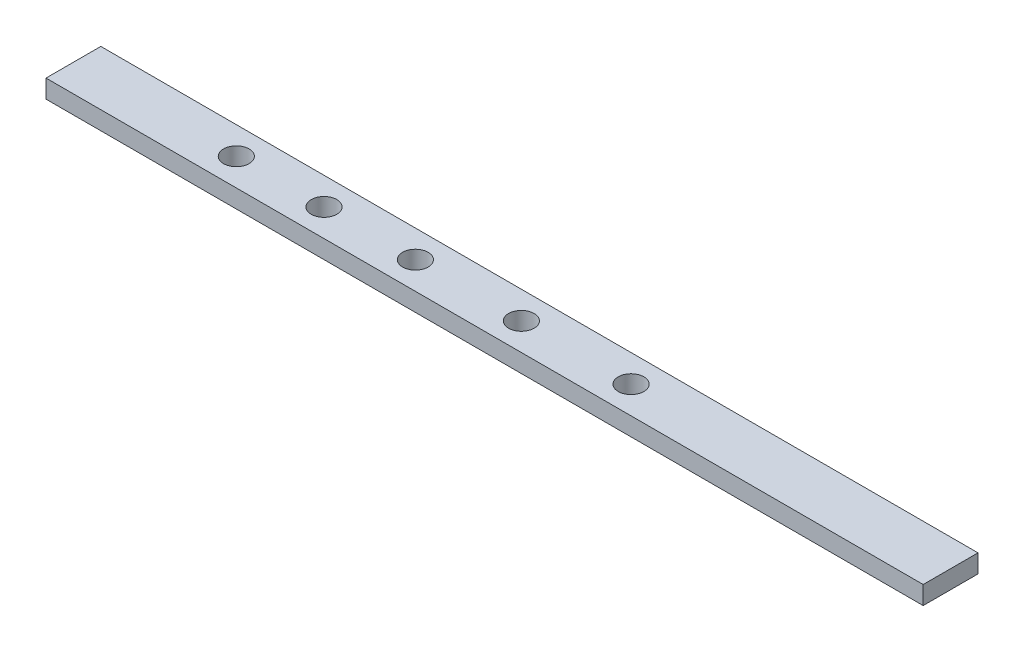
ISO-10303-21;
HEADER;
FILE_DESCRIPTION(('STEP AP214'),'2;1');
FILE_NAME('part.step','',(''),(''),'','','');
FILE_SCHEMA(('AUTOMOTIVE_DESIGN { 1 0 10303 214 1 1 1 1 }'));
ENDSEC;
DATA;
#1=APPLICATION_CONTEXT('core data for automotive mechanical design processes');
#2=APPLICATION_PROTOCOL_DEFINITION('international standard','automotive_design',2000,#1);
#3=PRODUCT_CONTEXT('',#1,'mechanical');
#4=PRODUCT('Part','Part','',(#3));
#5=PRODUCT_RELATED_PRODUCT_CATEGORY('part','',(#4));
#6=PRODUCT_DEFINITION_FORMATION('','',#4);
#7=PRODUCT_DEFINITION_CONTEXT('part definition',#1,'design');
#8=PRODUCT_DEFINITION('design','',#6,#7);
#9=PRODUCT_DEFINITION_SHAPE('','',#8);
#10=(LENGTH_UNIT() NAMED_UNIT(*) SI_UNIT(.MILLI.,.METRE.));
#11=(NAMED_UNIT(*) PLANE_ANGLE_UNIT() SI_UNIT($,.RADIAN.));
#12=(NAMED_UNIT(*) SI_UNIT($,.STERADIAN.) SOLID_ANGLE_UNIT());
#13=UNCERTAINTY_MEASURE_WITH_UNIT(LENGTH_MEASURE(1.E-05),#10,'distance_accuracy_value','');
#14=(GEOMETRIC_REPRESENTATION_CONTEXT(3) GLOBAL_UNCERTAINTY_ASSIGNED_CONTEXT((#13)) GLOBAL_UNIT_ASSIGNED_CONTEXT((#10,
#11,#12)) REPRESENTATION_CONTEXT('',''));
#15=CARTESIAN_POINT('',(0.,0.,0.));
#16=DIRECTION('',(0.,0.,1.));
#17=DIRECTION('',(1.,0.,0.));
#18=AXIS2_PLACEMENT_3D('',#15,#16,#17);
#19=CARTESIAN_POINT('',(200.603333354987,6.35,-25.9182663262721));
#20=DIRECTION('',(-1.,0.,0.));
#21=DIRECTION('',(0.,0.,1.));
#22=AXIS2_PLACEMENT_3D('',#19,#20,#21);
#23=PLANE('',#22);
#24=DIRECTION('',(0.,0.,-1.));
#25=VECTOR('',#24,1.);
#26=CARTESIAN_POINT('',(200.603333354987,0.,-25.9182663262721));
#27=LINE('',#26,#25);
#28=CARTESIAN_POINT('',(200.603333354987,0.,-6.86826632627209));
#29=VERTEX_POINT('',#28);
#30=CARTESIAN_POINT('',(200.603333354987,0.,-25.9182663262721));
#31=VERTEX_POINT('',#30);
#32=EDGE_CURVE('E94',#29,#31,#27,.T.);
#33=ORIENTED_EDGE('',*,*,#32,.T.);
#34=DIRECTION('',(0.,-1.,0.));
#35=VECTOR('',#34,1.);
#36=CARTESIAN_POINT('',(200.603333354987,6.35,-25.9182663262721));
#37=LINE('',#36,#35);
#38=CARTESIAN_POINT('',(200.603333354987,6.35,-25.9182663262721));
#39=VERTEX_POINT('',#38);
#40=EDGE_CURVE('E11',#39,#31,#37,.T.);
#41=ORIENTED_EDGE('',*,*,#40,.F.);
#42=DIRECTION('',(0.,0.,-1.));
#43=VECTOR('',#42,1.);
#44=CARTESIAN_POINT('',(200.603333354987,6.35,-25.9182663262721));
#45=LINE('',#44,#43);
#46=CARTESIAN_POINT('',(200.603333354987,6.35,-6.86826632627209));
#47=VERTEX_POINT('',#46);
#48=EDGE_CURVE('E82',#47,#39,#45,.T.);
#49=ORIENTED_EDGE('',*,*,#48,.F.);
#50=DIRECTION('',(0.,-1.,0.));
#51=VECTOR('',#50,1.);
#52=CARTESIAN_POINT('',(200.603333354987,6.35,-6.86826632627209));
#53=LINE('',#52,#51);
#54=EDGE_CURVE('E90',#47,#29,#53,.T.);
#55=ORIENTED_EDGE('',*,*,#54,.T.);
#56=EDGE_LOOP('',(#33,#41,#49,#55));
#57=FACE_BOUND('',#56,.T.);
#58=ADVANCED_FACE('F31',(#57),#23,.F.);
#59=CARTESIAN_POINT('',(-104.196666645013,6.35,-25.9182663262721));
#60=DIRECTION('',(0.,0.,1.));
#61=DIRECTION('',(1.,0.,0.));
#62=AXIS2_PLACEMENT_3D('',#59,#60,#61);
#63=PLANE('',#62);
#64=DIRECTION('',(-1.,0.,0.));
#65=VECTOR('',#64,1.);
#66=CARTESIAN_POINT('',(-104.196666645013,0.,-25.9182663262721));
#67=LINE('',#66,#65);
#68=CARTESIAN_POINT('',(-104.196666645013,0.,-25.9182663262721));
#69=VERTEX_POINT('',#68);
#70=EDGE_CURVE('E86',#31,#69,#67,.T.);
#71=ORIENTED_EDGE('',*,*,#70,.T.);
#72=DIRECTION('',(0.,-1.,0.));
#73=VECTOR('',#72,1.);
#74=CARTESIAN_POINT('',(-104.196666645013,6.35,-25.9182663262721));
#75=LINE('',#74,#73);
#76=CARTESIAN_POINT('',(-104.196666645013,6.35,-25.9182663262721));
#77=VERTEX_POINT('',#76);
#78=EDGE_CURVE('E39',#77,#69,#75,.T.);
#79=ORIENTED_EDGE('',*,*,#78,.F.);
#80=DIRECTION('',(-1.,0.,0.));
#81=VECTOR('',#80,1.);
#82=CARTESIAN_POINT('',(-104.196666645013,6.35,-25.9182663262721));
#83=LINE('',#82,#81);
#84=EDGE_CURVE('E77',#39,#77,#83,.T.);
#85=ORIENTED_EDGE('',*,*,#84,.F.);
#86=ORIENTED_EDGE('',*,*,#40,.T.);
#87=EDGE_LOOP('',(#71,#79,#85,#86));
#88=FACE_BOUND('',#87,.T.);
#89=ADVANCED_FACE('F85',(#88),#63,.F.);
#90=CARTESIAN_POINT('',(-104.196666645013,6.35,-25.9182663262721));
#91=DIRECTION('',(1.,0.,0.));
#92=DIRECTION('',(0.,0.,-1.));
#93=AXIS2_PLACEMENT_3D('',#90,#91,#92);
#94=PLANE('',#93);
#95=DIRECTION('',(0.,0.,1.));
#96=VECTOR('',#95,1.);
#97=CARTESIAN_POINT('',(-104.196666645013,0.,-25.9182663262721));
#98=LINE('',#97,#96);
#99=CARTESIAN_POINT('',(-104.196666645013,0.,-6.86826632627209));
#100=VERTEX_POINT('',#99);
#101=EDGE_CURVE('E64',#69,#100,#98,.T.);
#102=ORIENTED_EDGE('',*,*,#101,.T.);
#103=DIRECTION('',(0.,-1.,0.));
#104=VECTOR('',#103,1.);
#105=CARTESIAN_POINT('',(-104.196666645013,6.35,-6.86826632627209));
#106=LINE('',#105,#104);
#107=CARTESIAN_POINT('',(-104.196666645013,6.35,-6.86826632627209));
#108=VERTEX_POINT('',#107);
#109=EDGE_CURVE('E87',#108,#100,#106,.T.);
#110=ORIENTED_EDGE('',*,*,#109,.F.);
#111=DIRECTION('',(0.,0.,1.));
#112=VECTOR('',#111,1.);
#113=CARTESIAN_POINT('',(-104.196666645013,6.35,-25.9182663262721));
#114=LINE('',#113,#112);
#115=EDGE_CURVE('E80',#77,#108,#114,.T.);
#116=ORIENTED_EDGE('',*,*,#115,.F.);
#117=ORIENTED_EDGE('',*,*,#78,.T.);
#118=EDGE_LOOP('',(#102,#110,#116,#117));
#119=FACE_BOUND('',#118,.T.);
#120=ADVANCED_FACE('F88',(#119),#94,.F.);
#121=CARTESIAN_POINT('',(-104.196666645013,6.35,-6.86826632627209));
#122=DIRECTION('',(0.,0.,-1.));
#123=DIRECTION('',(-1.,0.,0.));
#124=AXIS2_PLACEMENT_3D('',#121,#122,#123);
#125=PLANE('',#124);
#126=DIRECTION('',(1.,0.,0.));
#127=VECTOR('',#126,1.);
#128=CARTESIAN_POINT('',(-104.196666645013,0.,-6.86826632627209));
#129=LINE('',#128,#127);
#130=EDGE_CURVE('E70',#100,#29,#129,.T.);
#131=ORIENTED_EDGE('',*,*,#130,.T.);
#132=ORIENTED_EDGE('',*,*,#54,.F.);
#133=DIRECTION('',(1.,0.,0.));
#134=VECTOR('',#133,1.);
#135=CARTESIAN_POINT('',(-104.196666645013,6.35,-6.86826632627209));
#136=LINE('',#135,#134);
#137=EDGE_CURVE('E47',#108,#47,#136,.T.);
#138=ORIENTED_EDGE('',*,*,#137,.F.);
#139=ORIENTED_EDGE('',*,*,#109,.T.);
#140=EDGE_LOOP('',(#131,#132,#138,#139));
#141=FACE_BOUND('',#140,.T.);
#142=ADVANCED_FACE('F102',(#141),#125,.F.);
#143=CARTESIAN_POINT('',(200.603333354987,6.35,-6.86826632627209));
#144=DIRECTION('',(0.,1.,0.));
#145=DIRECTION('',(0.,0.,1.));
#146=AXIS2_PLACEMENT_3D('',#143,#144,#145);
#147=PLANE('',#146);
#148=CARTESIAN_POINT('',(89.5617891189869,6.35,-16.3932663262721));
#149=DIRECTION('',(0.,-1.,0.));
#150=DIRECTION('',(0.,0.,-1.));
#151=AXIS2_PLACEMENT_3D('',#148,#149,#150);
#152=CIRCLE('',#151,4.445);
#153=CARTESIAN_POINT('',(89.5617891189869,6.35,-20.8382663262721));
#154=VERTEX_POINT('',#153);
#155=EDGE_CURVE('E129',#154,#154,#152,.T.);
#156=ORIENTED_EDGE('',*,*,#155,.T.);
#157=EDGE_LOOP('',(#156));
#158=FACE_BOUND('',#157,.T.);
#159=CARTESIAN_POINT('',(51.4617891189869,6.35,-16.3932663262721));
#160=DIRECTION('',(0.,-1.,0.));
#161=DIRECTION('',(0.,0.,-1.));
#162=AXIS2_PLACEMENT_3D('',#159,#160,#161);
#163=CIRCLE('',#162,4.445);
#164=CARTESIAN_POINT('',(51.4617891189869,6.35,-20.8382663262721));
#165=VERTEX_POINT('',#164);
#166=EDGE_CURVE('E123',#165,#165,#163,.T.);
#167=ORIENTED_EDGE('',*,*,#166,.T.);
#168=EDGE_LOOP('',(#167));
#169=FACE_BOUND('',#168,.T.);
#170=CARTESIAN_POINT('',(14.6317891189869,6.35,-16.3932663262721));
#171=DIRECTION('',(0.,-1.,0.));
#172=DIRECTION('',(0.,0.,-1.));
#173=AXIS2_PLACEMENT_3D('',#170,#171,#172);
#174=CIRCLE('',#173,4.445);
#175=CARTESIAN_POINT('',(14.6317891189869,6.35,-20.8382663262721));
#176=VERTEX_POINT('',#175);
#177=EDGE_CURVE('E117',#176,#176,#174,.T.);
#178=ORIENTED_EDGE('',*,*,#177,.T.);
#179=EDGE_LOOP('',(#178));
#180=FACE_BOUND('',#179,.T.);
#181=CARTESIAN_POINT('',(-17.1182108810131,6.35,-16.3932663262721));
#182=DIRECTION('',(0.,-1.,0.));
#183=DIRECTION('',(0.,0.,-1.));
#184=AXIS2_PLACEMENT_3D('',#181,#182,#183);
#185=CIRCLE('',#184,4.445);
#186=CARTESIAN_POINT('',(-17.1182108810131,6.35,-20.8382663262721));
#187=VERTEX_POINT('',#186);
#188=EDGE_CURVE('E111',#187,#187,#185,.T.);
#189=ORIENTED_EDGE('',*,*,#188,.T.);
#190=EDGE_LOOP('',(#189));
#191=FACE_BOUND('',#190,.T.);
#192=CARTESIAN_POINT('',(-47.5982108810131,6.35,-16.3932663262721));
#193=DIRECTION('',(0.,-1.,0.));
#194=DIRECTION('',(0.,0.,-1.));
#195=AXIS2_PLACEMENT_3D('',#192,#193,#194);
#196=CIRCLE('',#195,4.445);
#197=CARTESIAN_POINT('',(-47.5982108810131,6.35,-20.8382663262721));
#198=VERTEX_POINT('',#197);
#199=EDGE_CURVE('E97',#198,#198,#196,.T.);
#200=ORIENTED_EDGE('',*,*,#199,.T.);
#201=EDGE_LOOP('',(#200));
#202=FACE_BOUND('',#201,.T.);
#203=ORIENTED_EDGE('',*,*,#48,.T.);
#204=ORIENTED_EDGE('',*,*,#84,.T.);
#205=ORIENTED_EDGE('',*,*,#115,.T.);
#206=ORIENTED_EDGE('',*,*,#137,.T.);
#207=EDGE_LOOP('',(#203,#204,#205,#206));
#208=FACE_BOUND('',#207,.T.);
#209=ADVANCED_FACE('F78',(#158,#169,#180,#191,#202,#208),#147,.T.);
#210=CARTESIAN_POINT('',(200.603333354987,0.,-6.86826632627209));
#211=DIRECTION('',(0.,1.,0.));
#212=DIRECTION('',(0.,0.,1.));
#213=AXIS2_PLACEMENT_3D('',#210,#211,#212);
#214=PLANE('',#213);
#215=CARTESIAN_POINT('',(89.5617891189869,0.,-16.3932663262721));
#216=DIRECTION('',(0.,-1.,0.));
#217=DIRECTION('',(0.,0.,-1.));
#218=AXIS2_PLACEMENT_3D('',#215,#216,#217);
#219=CIRCLE('',#218,4.445);
#220=CARTESIAN_POINT('',(89.5617891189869,0.,-20.8382663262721));
#221=VERTEX_POINT('',#220);
#222=EDGE_CURVE('E132',#221,#221,#219,.T.);
#223=ORIENTED_EDGE('',*,*,#222,.F.);
#224=EDGE_LOOP('',(#223));
#225=FACE_BOUND('',#224,.T.);
#226=CARTESIAN_POINT('',(51.4617891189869,0.,-16.3932663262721));
#227=DIRECTION('',(0.,-1.,0.));
#228=DIRECTION('',(0.,0.,-1.));
#229=AXIS2_PLACEMENT_3D('',#226,#227,#228);
#230=CIRCLE('',#229,4.445);
#231=CARTESIAN_POINT('',(51.4617891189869,0.,-20.8382663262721));
#232=VERTEX_POINT('',#231);
#233=EDGE_CURVE('E126',#232,#232,#230,.T.);
#234=ORIENTED_EDGE('',*,*,#233,.F.);
#235=EDGE_LOOP('',(#234));
#236=FACE_BOUND('',#235,.T.);
#237=CARTESIAN_POINT('',(14.6317891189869,0.,-16.3932663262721));
#238=DIRECTION('',(0.,-1.,0.));
#239=DIRECTION('',(0.,0.,-1.));
#240=AXIS2_PLACEMENT_3D('',#237,#238,#239);
#241=CIRCLE('',#240,4.445);
#242=CARTESIAN_POINT('',(14.6317891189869,0.,-20.8382663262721));
#243=VERTEX_POINT('',#242);
#244=EDGE_CURVE('E120',#243,#243,#241,.T.);
#245=ORIENTED_EDGE('',*,*,#244,.F.);
#246=EDGE_LOOP('',(#245));
#247=FACE_BOUND('',#246,.T.);
#248=CARTESIAN_POINT('',(-17.1182108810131,0.,-16.3932663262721));
#249=DIRECTION('',(0.,-1.,0.));
#250=DIRECTION('',(0.,0.,-1.));
#251=AXIS2_PLACEMENT_3D('',#248,#249,#250);
#252=CIRCLE('',#251,4.445);
#253=CARTESIAN_POINT('',(-17.1182108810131,0.,-20.8382663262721));
#254=VERTEX_POINT('',#253);
#255=EDGE_CURVE('E114',#254,#254,#252,.T.);
#256=ORIENTED_EDGE('',*,*,#255,.F.);
#257=EDGE_LOOP('',(#256));
#258=FACE_BOUND('',#257,.T.);
#259=CARTESIAN_POINT('',(-47.5982108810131,0.,-16.3932663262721));
#260=DIRECTION('',(0.,-1.,0.));
#261=DIRECTION('',(0.,0.,-1.));
#262=AXIS2_PLACEMENT_3D('',#259,#260,#261);
#263=CIRCLE('',#262,4.445);
#264=CARTESIAN_POINT('',(-47.5982108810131,0.,-20.8382663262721));
#265=VERTEX_POINT('',#264);
#266=EDGE_CURVE('E108',#265,#265,#263,.T.);
#267=ORIENTED_EDGE('',*,*,#266,.F.);
#268=EDGE_LOOP('',(#267));
#269=FACE_BOUND('',#268,.T.);
#270=ORIENTED_EDGE('',*,*,#32,.F.);
#271=ORIENTED_EDGE('',*,*,#130,.F.);
#272=ORIENTED_EDGE('',*,*,#101,.F.);
#273=ORIENTED_EDGE('',*,*,#70,.F.);
#274=EDGE_LOOP('',(#270,#271,#272,#273));
#275=FACE_BOUND('',#274,.T.);
#276=ADVANCED_FACE('F105',(#225,#236,#247,#258,#269,#275),#214,.F.);
#277=CARTESIAN_POINT('',(-47.5982108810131,6.35,-16.3932663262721));
#278=DIRECTION('',(0.,-1.,0.));
#279=DIRECTION('',(0.,0.,-1.));
#280=AXIS2_PLACEMENT_3D('',#277,#278,#279);
#281=CYLINDRICAL_SURFACE('',#280,4.445);
#282=ORIENTED_EDGE('',*,*,#199,.F.);
#283=EDGE_LOOP('',(#282));
#284=FACE_BOUND('',#283,.T.);
#285=ORIENTED_EDGE('',*,*,#266,.T.);
#286=EDGE_LOOP('',(#285));
#287=FACE_BOUND('',#286,.T.);
#288=ADVANCED_FACE('F149',(#284,#287),#281,.F.);
#289=CARTESIAN_POINT('',(-17.1182108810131,6.35,-16.3932663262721));
#290=DIRECTION('',(0.,-1.,0.));
#291=DIRECTION('',(0.,0.,-1.));
#292=AXIS2_PLACEMENT_3D('',#289,#290,#291);
#293=CYLINDRICAL_SURFACE('',#292,4.445);
#294=ORIENTED_EDGE('',*,*,#188,.F.);
#295=EDGE_LOOP('',(#294));
#296=FACE_BOUND('',#295,.T.);
#297=ORIENTED_EDGE('',*,*,#255,.T.);
#298=EDGE_LOOP('',(#297));
#299=FACE_BOUND('',#298,.T.);
#300=ADVANCED_FACE('F160',(#296,#299),#293,.F.);
#301=CARTESIAN_POINT('',(14.6317891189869,6.35,-16.3932663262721));
#302=DIRECTION('',(0.,-1.,0.));
#303=DIRECTION('',(0.,0.,-1.));
#304=AXIS2_PLACEMENT_3D('',#301,#302,#303);
#305=CYLINDRICAL_SURFACE('',#304,4.445);
#306=ORIENTED_EDGE('',*,*,#177,.F.);
#307=EDGE_LOOP('',(#306));
#308=FACE_BOUND('',#307,.T.);
#309=ORIENTED_EDGE('',*,*,#244,.T.);
#310=EDGE_LOOP('',(#309));
#311=FACE_BOUND('',#310,.T.);
#312=ADVANCED_FACE('F166',(#308,#311),#305,.F.);
#313=CARTESIAN_POINT('',(51.4617891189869,6.35,-16.3932663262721));
#314=DIRECTION('',(0.,-1.,0.));
#315=DIRECTION('',(0.,0.,-1.));
#316=AXIS2_PLACEMENT_3D('',#313,#314,#315);
#317=CYLINDRICAL_SURFACE('',#316,4.445);
#318=ORIENTED_EDGE('',*,*,#166,.F.);
#319=EDGE_LOOP('',(#318));
#320=FACE_BOUND('',#319,.T.);
#321=ORIENTED_EDGE('',*,*,#233,.T.);
#322=EDGE_LOOP('',(#321));
#323=FACE_BOUND('',#322,.T.);
#324=ADVANCED_FACE('F143',(#320,#323),#317,.F.);
#325=CARTESIAN_POINT('',(89.5617891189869,6.35,-16.3932663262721));
#326=DIRECTION('',(0.,-1.,0.));
#327=DIRECTION('',(0.,0.,-1.));
#328=AXIS2_PLACEMENT_3D('',#325,#326,#327);
#329=CYLINDRICAL_SURFACE('',#328,4.445);
#330=ORIENTED_EDGE('',*,*,#155,.F.);
#331=EDGE_LOOP('',(#330));
#332=FACE_BOUND('',#331,.T.);
#333=ORIENTED_EDGE('',*,*,#222,.T.);
#334=EDGE_LOOP('',(#333));
#335=FACE_BOUND('',#334,.T.);
#336=ADVANCED_FACE('F140',(#332,#335),#329,.F.);
#337=CLOSED_SHELL('',(#58,#89,#120,#142,#209,#276,#288,#300,#312,#324,#336));
#338=MANIFOLD_SOLID_BREP('B2',#337);
#339=ADVANCED_BREP_SHAPE_REPRESENTATION('',(#18,#338),#14);
#340=SHAPE_DEFINITION_REPRESENTATION(#9,#339);
ENDSEC;
END-ISO-10303-21;
